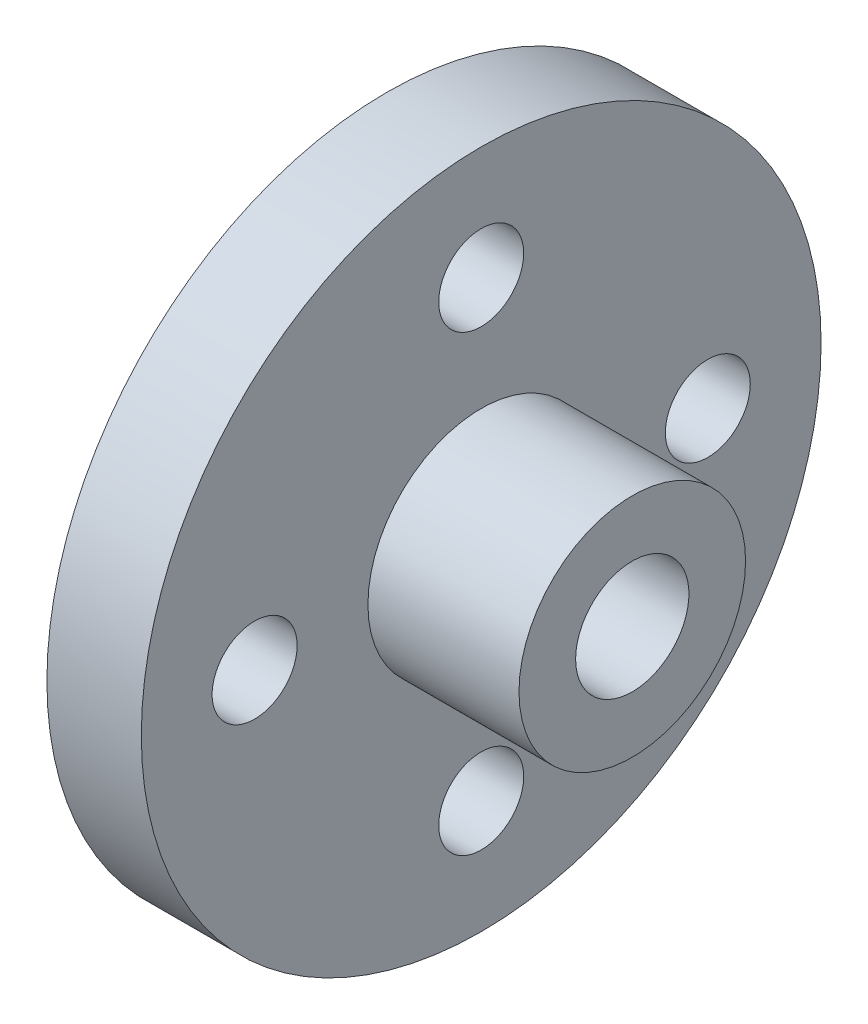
ISO-10303-21;
HEADER;
FILE_DESCRIPTION(('STEP AP214'),'2;1');
FILE_NAME('part.step','',(''),(''),'','','');
FILE_SCHEMA(('AUTOMOTIVE_DESIGN { 1 0 10303 214 1 1 1 1 }'));
ENDSEC;
DATA;
#1=APPLICATION_CONTEXT('core data for automotive mechanical design processes');
#2=APPLICATION_PROTOCOL_DEFINITION('international standard','automotive_design',2000,#1);
#3=PRODUCT_CONTEXT('',#1,'mechanical');
#4=PRODUCT('Part','Part','',(#3));
#5=PRODUCT_RELATED_PRODUCT_CATEGORY('part','',(#4));
#6=PRODUCT_DEFINITION_FORMATION('','',#4);
#7=PRODUCT_DEFINITION_CONTEXT('part definition',#1,'design');
#8=PRODUCT_DEFINITION('design','',#6,#7);
#9=PRODUCT_DEFINITION_SHAPE('','',#8);
#10=(LENGTH_UNIT() NAMED_UNIT(*) SI_UNIT(.MILLI.,.METRE.));
#11=(NAMED_UNIT(*) PLANE_ANGLE_UNIT() SI_UNIT($,.RADIAN.));
#12=(NAMED_UNIT(*) SI_UNIT($,.STERADIAN.) SOLID_ANGLE_UNIT());
#13=UNCERTAINTY_MEASURE_WITH_UNIT(LENGTH_MEASURE(1.E-05),#10,'distance_accuracy_value','');
#14=(GEOMETRIC_REPRESENTATION_CONTEXT(3) GLOBAL_UNCERTAINTY_ASSIGNED_CONTEXT((#13)) GLOBAL_UNIT_ASSIGNED_CONTEXT((#10,
#11,#12)) REPRESENTATION_CONTEXT('',''));
#15=CARTESIAN_POINT('',(0.,0.,0.));
#16=DIRECTION('',(0.,0.,1.));
#17=DIRECTION('',(1.,0.,0.));
#18=AXIS2_PLACEMENT_3D('',#15,#16,#17);
#19=CARTESIAN_POINT('',(-7.9375,0.,0.));
#20=DIRECTION('',(1.,0.,0.));
#21=DIRECTION('',(0.,0.,-1.));
#22=AXIS2_PLACEMENT_3D('',#19,#20,#21);
#23=PLANE('',#22);
#24=CARTESIAN_POINT('',(-7.9375,0.,0.));
#25=DIRECTION('',(-1.,0.,0.));
#26=DIRECTION('',(0.,0.,1.));
#27=AXIS2_PLACEMENT_3D('',#24,#25,#26);
#28=CIRCLE('',#27,28.575);
#29=CARTESIAN_POINT('',(-7.9375,0.,28.575));
#30=VERTEX_POINT('',#29);
#31=EDGE_CURVE('E10',#30,#30,#28,.T.);
#32=ORIENTED_EDGE('',*,*,#31,.T.);
#33=EDGE_LOOP('',(#32));
#34=FACE_BOUND('',#33,.T.);
#35=CARTESIAN_POINT('',(-7.9375,19.05,0.));
#36=DIRECTION('',(1.,0.,0.));
#37=DIRECTION('',(0.,0.,-1.));
#38=AXIS2_PLACEMENT_3D('',#35,#36,#37);
#39=CIRCLE('',#38,3.571875);
#40=CARTESIAN_POINT('',(-7.9375,19.05,-3.571875));
#41=VERTEX_POINT('',#40);
#42=EDGE_CURVE('E48',#41,#41,#39,.T.);
#43=ORIENTED_EDGE('',*,*,#42,.T.);
#44=EDGE_LOOP('',(#43));
#45=FACE_BOUND('',#44,.T.);
#46=CARTESIAN_POINT('',(-7.9375,0.,19.05));
#47=DIRECTION('',(1.,0.,0.));
#48=DIRECTION('',(0.,1.,0.));
#49=AXIS2_PLACEMENT_3D('',#46,#47,#48);
#50=CIRCLE('',#49,3.571875);
#51=CARTESIAN_POINT('',(-7.9375,0.,15.478125));
#52=VERTEX_POINT('',#51);
#53=EDGE_CURVE('E54',#52,#52,#50,.T.);
#54=ORIENTED_EDGE('',*,*,#53,.T.);
#55=EDGE_LOOP('',(#54));
#56=FACE_BOUND('',#55,.T.);
#57=CARTESIAN_POINT('',(-7.9375,-19.05,-1.33025516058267E-13));
#58=DIRECTION('',(1.,0.,0.));
#59=DIRECTION('',(0.,0.,1.));
#60=AXIS2_PLACEMENT_3D('',#57,#58,#59);
#61=CIRCLE('',#60,3.571875);
#62=CARTESIAN_POINT('',(-7.9375,-19.05,-3.57187500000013));
#63=VERTEX_POINT('',#62);
#64=EDGE_CURVE('E60',#63,#63,#61,.T.);
#65=ORIENTED_EDGE('',*,*,#64,.T.);
#66=EDGE_LOOP('',(#65));
#67=FACE_BOUND('',#66,.T.);
#68=CARTESIAN_POINT('',(-7.9375,1.99538274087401E-13,-19.05));
#69=DIRECTION('',(1.,0.,0.));
#70=DIRECTION('',(0.,-1.,0.));
#71=AXIS2_PLACEMENT_3D('',#68,#69,#70);
#72=CIRCLE('',#71,3.571875);
#73=CARTESIAN_POINT('',(-7.9375,1.99538274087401E-13,-22.621875));
#74=VERTEX_POINT('',#73);
#75=EDGE_CURVE('E66',#74,#74,#72,.T.);
#76=ORIENTED_EDGE('',*,*,#75,.T.);
#77=EDGE_LOOP('',(#76));
#78=FACE_BOUND('',#77,.T.);
#79=CARTESIAN_POINT('',(-7.9375,0.,0.));
#80=DIRECTION('',(-1.,0.,0.));
#81=DIRECTION('',(0.,0.,1.));
#82=AXIS2_PLACEMENT_3D('',#79,#80,#81);
#83=CIRCLE('',#82,4.191);
#84=CARTESIAN_POINT('',(-7.9375,0.,4.191));
#85=VERTEX_POINT('',#84);
#86=EDGE_CURVE('E72',#85,#85,#83,.T.);
#87=ORIENTED_EDGE('',*,*,#86,.F.);
#88=EDGE_LOOP('',(#87));
#89=FACE_BOUND('',#88,.T.);
#90=ADVANCED_FACE('F29',(#34,#45,#56,#67,#78,#89),#23,.F.);
#91=CARTESIAN_POINT('',(12.7,9.525,0.));
#92=DIRECTION('',(-1.,0.,0.));
#93=DIRECTION('',(0.,0.,1.));
#94=AXIS2_PLACEMENT_3D('',#91,#92,#93);
#95=PLANE('',#94);
#96=CARTESIAN_POINT('',(12.7,0.,0.));
#97=DIRECTION('',(-1.,0.,0.));
#98=DIRECTION('',(0.,0.,1.));
#99=AXIS2_PLACEMENT_3D('',#96,#97,#98);
#100=CIRCLE('',#99,9.525);
#101=CARTESIAN_POINT('',(12.7,0.,9.525));
#102=VERTEX_POINT('',#101);
#103=EDGE_CURVE('E43',#102,#102,#100,.T.);
#104=ORIENTED_EDGE('',*,*,#103,.F.);
#105=EDGE_LOOP('',(#104));
#106=FACE_BOUND('',#105,.T.);
#107=CARTESIAN_POINT('',(12.7,0.,0.));
#108=DIRECTION('',(-1.,0.,0.));
#109=DIRECTION('',(0.,0.,1.));
#110=AXIS2_PLACEMENT_3D('',#107,#108,#109);
#111=CIRCLE('',#110,4.7625);
#112=CARTESIAN_POINT('',(12.7,0.,4.7625));
#113=VERTEX_POINT('',#112);
#114=EDGE_CURVE('E81',#113,#113,#111,.T.);
#115=ORIENTED_EDGE('',*,*,#114,.T.);
#116=EDGE_LOOP('',(#115));
#117=FACE_BOUND('',#116,.T.);
#118=ADVANCED_FACE('F85',(#106,#117),#95,.F.);
#119=CARTESIAN_POINT('',(-16.9594650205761,0.,0.));
#120=DIRECTION('',(-1.,0.,0.));
#121=DIRECTION('',(0.,0.,1.));
#122=AXIS2_PLACEMENT_3D('',#119,#120,#121);
#123=CYLINDRICAL_SURFACE('',#122,28.575);
#124=ORIENTED_EDGE('',*,*,#31,.F.);
#125=EDGE_LOOP('',(#124));
#126=FACE_BOUND('',#125,.T.);
#127=CARTESIAN_POINT('',(0.,0.,0.));
#128=DIRECTION('',(-1.,0.,0.));
#129=DIRECTION('',(0.,0.,1.));
#130=AXIS2_PLACEMENT_3D('',#127,#128,#129);
#131=CIRCLE('',#130,28.575);
#132=CARTESIAN_POINT('',(0.,0.,28.575));
#133=VERTEX_POINT('',#132);
#134=EDGE_CURVE('E35',#133,#133,#131,.T.);
#135=ORIENTED_EDGE('',*,*,#134,.T.);
#136=EDGE_LOOP('',(#135));
#137=FACE_BOUND('',#136,.T.);
#138=ADVANCED_FACE('F102',(#126,#137),#123,.T.);
#139=CARTESIAN_POINT('',(0.,28.575,0.));
#140=DIRECTION('',(-1.,0.,0.));
#141=DIRECTION('',(0.,0.,1.));
#142=AXIS2_PLACEMENT_3D('',#139,#140,#141);
#143=PLANE('',#142);
#144=CARTESIAN_POINT('',(0.,1.99538274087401E-13,-19.05));
#145=DIRECTION('',(1.,0.,0.));
#146=DIRECTION('',(0.,-1.,0.));
#147=AXIS2_PLACEMENT_3D('',#144,#145,#146);
#148=CIRCLE('',#147,3.571875);
#149=CARTESIAN_POINT('',(0.,1.99538274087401E-13,-22.621875));
#150=VERTEX_POINT('',#149);
#151=EDGE_CURVE('E69',#150,#150,#148,.T.);
#152=ORIENTED_EDGE('',*,*,#151,.F.);
#153=EDGE_LOOP('',(#152));
#154=FACE_BOUND('',#153,.T.);
#155=CARTESIAN_POINT('',(0.,-19.05,-1.33025516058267E-13));
#156=DIRECTION('',(1.,0.,0.));
#157=DIRECTION('',(0.,0.,1.));
#158=AXIS2_PLACEMENT_3D('',#155,#156,#157);
#159=CIRCLE('',#158,3.571875);
#160=CARTESIAN_POINT('',(0.,-19.05,-3.57187500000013));
#161=VERTEX_POINT('',#160);
#162=EDGE_CURVE('E63',#161,#161,#159,.T.);
#163=ORIENTED_EDGE('',*,*,#162,.F.);
#164=EDGE_LOOP('',(#163));
#165=FACE_BOUND('',#164,.T.);
#166=CARTESIAN_POINT('',(0.,0.,19.05));
#167=DIRECTION('',(1.,0.,0.));
#168=DIRECTION('',(0.,1.,0.));
#169=AXIS2_PLACEMENT_3D('',#166,#167,#168);
#170=CIRCLE('',#169,3.571875);
#171=CARTESIAN_POINT('',(0.,0.,15.478125));
#172=VERTEX_POINT('',#171);
#173=EDGE_CURVE('E57',#172,#172,#170,.T.);
#174=ORIENTED_EDGE('',*,*,#173,.F.);
#175=EDGE_LOOP('',(#174));
#176=FACE_BOUND('',#175,.T.);
#177=CARTESIAN_POINT('',(0.,19.05,0.));
#178=DIRECTION('',(1.,0.,0.));
#179=DIRECTION('',(0.,0.,-1.));
#180=AXIS2_PLACEMENT_3D('',#177,#178,#179);
#181=CIRCLE('',#180,3.571875);
#182=CARTESIAN_POINT('',(0.,19.05,-3.571875));
#183=VERTEX_POINT('',#182);
#184=EDGE_CURVE('E51',#183,#183,#181,.T.);
#185=ORIENTED_EDGE('',*,*,#184,.F.);
#186=EDGE_LOOP('',(#185));
#187=FACE_BOUND('',#186,.T.);
#188=ORIENTED_EDGE('',*,*,#134,.F.);
#189=EDGE_LOOP('',(#188));
#190=FACE_BOUND('',#189,.T.);
#191=CARTESIAN_POINT('',(0.,0.,0.));
#192=DIRECTION('',(-1.,0.,0.));
#193=DIRECTION('',(0.,0.,1.));
#194=AXIS2_PLACEMENT_3D('',#191,#192,#193);
#195=CIRCLE('',#194,9.525);
#196=CARTESIAN_POINT('',(0.,0.,9.525));
#197=VERTEX_POINT('',#196);
#198=EDGE_CURVE('E39',#197,#197,#195,.T.);
#199=ORIENTED_EDGE('',*,*,#198,.T.);
#200=EDGE_LOOP('',(#199));
#201=FACE_BOUND('',#200,.T.);
#202=ADVANCED_FACE('F144',(#154,#165,#176,#187,#190,#201),#143,.F.);
#203=CARTESIAN_POINT('',(-16.9594650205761,0.,0.));
#204=DIRECTION('',(-1.,0.,0.));
#205=DIRECTION('',(0.,0.,1.));
#206=AXIS2_PLACEMENT_3D('',#203,#204,#205);
#207=CYLINDRICAL_SURFACE('',#206,9.525);
#208=ORIENTED_EDGE('',*,*,#198,.F.);
#209=EDGE_LOOP('',(#208));
#210=FACE_BOUND('',#209,.T.);
#211=ORIENTED_EDGE('',*,*,#103,.T.);
#212=EDGE_LOOP('',(#211));
#213=FACE_BOUND('',#212,.T.);
#214=ADVANCED_FACE('F139',(#210,#213),#207,.T.);
#215=CARTESIAN_POINT('',(-7.9375,19.05,0.));
#216=DIRECTION('',(1.,0.,0.));
#217=DIRECTION('',(0.,0.,-1.));
#218=AXIS2_PLACEMENT_3D('',#215,#216,#217);
#219=CYLINDRICAL_SURFACE('',#218,3.571875);
#220=CARTESIAN_POINT('',(-7.9375,19.05,-3.571875));
#221=CARTESIAN_POINT('',(-7.85481770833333,19.05,-3.571875));
#222=CARTESIAN_POINT('',(-7.77213541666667,19.05,-3.571875));
#223=CARTESIAN_POINT('',(-7.60677083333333,19.05,-3.571875));
#224=CARTESIAN_POINT('',(-7.52408854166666,19.05,-3.571875));
#225=CARTESIAN_POINT('',(-7.35872395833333,19.05,-3.571875));
#226=CARTESIAN_POINT('',(-7.27604166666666,19.05,-3.571875));
#227=CARTESIAN_POINT('',(-7.11067708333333,19.05,-3.571875));
#228=CARTESIAN_POINT('',(-7.02799479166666,19.05,-3.571875));
#229=CARTESIAN_POINT('',(-6.86263020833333,19.05,-3.571875));
#230=CARTESIAN_POINT('',(-6.77994791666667,19.05,-3.571875));
#231=CARTESIAN_POINT('',(-6.61458333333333,19.05,-3.571875));
#232=CARTESIAN_POINT('',(-6.53190104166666,19.05,-3.571875));
#233=CARTESIAN_POINT('',(-6.36653645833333,19.05,-3.571875));
#234=CARTESIAN_POINT('',(-6.28385416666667,19.05,-3.571875));
#235=CARTESIAN_POINT('',(-6.11848958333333,19.05,-3.571875));
#236=CARTESIAN_POINT('',(-6.03580729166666,19.05,-3.571875));
#237=CARTESIAN_POINT('',(-5.87044270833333,19.05,-3.571875));
#238=CARTESIAN_POINT('',(-5.78776041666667,19.05,-3.571875));
#239=CARTESIAN_POINT('',(-5.62239583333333,19.05,-3.571875));
#240=CARTESIAN_POINT('',(-5.53971354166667,19.05,-3.571875));
#241=CARTESIAN_POINT('',(-5.37434895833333,19.05,-3.571875));
#242=CARTESIAN_POINT('',(-5.29166666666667,19.05,-3.571875));
#243=CARTESIAN_POINT('',(-5.12630208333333,19.05,-3.571875));
#244=CARTESIAN_POINT('',(-5.04361979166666,19.05,-3.571875));
#245=CARTESIAN_POINT('',(-4.87825520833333,19.05,-3.571875));
#246=CARTESIAN_POINT('',(-4.79557291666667,19.05,-3.571875));
#247=CARTESIAN_POINT('',(-4.63020833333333,19.05,-3.571875));
#248=CARTESIAN_POINT('',(-4.54752604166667,19.05,-3.571875));
#249=CARTESIAN_POINT('',(-4.38216145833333,19.05,-3.571875));
#250=CARTESIAN_POINT('',(-4.29947916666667,19.05,-3.571875));
#251=CARTESIAN_POINT('',(-4.13411458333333,19.05,-3.571875));
#252=CARTESIAN_POINT('',(-4.05143229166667,19.05,-3.571875));
#253=CARTESIAN_POINT('',(-3.88606770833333,19.05,-3.571875));
#254=CARTESIAN_POINT('',(-3.80338541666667,19.05,-3.571875));
#255=CARTESIAN_POINT('',(-3.63802083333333,19.05,-3.571875));
#256=CARTESIAN_POINT('',(-3.55533854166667,19.05,-3.571875));
#257=CARTESIAN_POINT('',(-3.38997395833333,19.05,-3.571875));
#258=CARTESIAN_POINT('',(-3.30729166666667,19.05,-3.571875));
#259=CARTESIAN_POINT('',(-3.14192708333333,19.05,-3.571875));
#260=CARTESIAN_POINT('',(-3.05924479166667,19.05,-3.571875));
#261=CARTESIAN_POINT('',(-2.89388020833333,19.05,-3.571875));
#262=CARTESIAN_POINT('',(-2.81119791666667,19.05,-3.571875));
#263=CARTESIAN_POINT('',(-2.64583333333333,19.05,-3.571875));
#264=CARTESIAN_POINT('',(-2.56315104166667,19.05,-3.571875));
#265=CARTESIAN_POINT('',(-2.39778645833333,19.05,-3.571875));
#266=CARTESIAN_POINT('',(-2.31510416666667,19.05,-3.571875));
#267=CARTESIAN_POINT('',(-2.14973958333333,19.05,-3.571875));
#268=CARTESIAN_POINT('',(-2.06705729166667,19.05,-3.571875));
#269=CARTESIAN_POINT('',(-1.90169270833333,19.05,-3.571875));
#270=CARTESIAN_POINT('',(-1.81901041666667,19.05,-3.571875));
#271=CARTESIAN_POINT('',(-1.65364583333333,19.05,-3.571875));
#272=CARTESIAN_POINT('',(-1.57096354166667,19.05,-3.571875));
#273=CARTESIAN_POINT('',(-1.40559895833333,19.05,-3.571875));
#274=CARTESIAN_POINT('',(-1.32291666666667,19.05,-3.571875));
#275=CARTESIAN_POINT('',(-1.15755208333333,19.05,-3.571875));
#276=CARTESIAN_POINT('',(-1.07486979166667,19.05,-3.571875));
#277=CARTESIAN_POINT('',(-0.909505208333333,19.05,-3.571875));
#278=CARTESIAN_POINT('',(-0.826822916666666,19.05,-3.571875));
#279=CARTESIAN_POINT('',(-0.661458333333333,19.05,-3.571875));
#280=CARTESIAN_POINT('',(-0.578776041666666,19.05,-3.571875));
#281=CARTESIAN_POINT('',(-0.413411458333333,19.05,-3.571875));
#282=CARTESIAN_POINT('',(-0.330729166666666,19.05,-3.571875));
#283=CARTESIAN_POINT('',(-0.165364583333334,19.05,-3.571875));
#284=CARTESIAN_POINT('',(-0.0826822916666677,19.05,-3.571875));
#285=CARTESIAN_POINT('',(0.,19.05,-3.571875));
#286=B_SPLINE_CURVE_WITH_KNOTS('',3,(#220,#221,#222,#223,#224,#225,#226,#227,#228,#229,#230,
#231,#232,#233,#234,#235,#236,#237,#238,#239,#240,#241,#242,#243,#244,#245,#246,#247,#248,#249,
#250,#251,#252,#253,#254,#255,#256,#257,#258,#259,#260,#261,#262,#263,#264,#265,#266,#267,#268,
#269,#270,#271,#272,#273,#274,#275,#276,#277,#278,#279,#280,#281,#282,#283,#284,#285),
.UNSPECIFIED.,.F.,.F.,(4,2,2,2,2,2,2,2,2,2,2,2,2,2,2,2,2,2,2,2,2,2,2,2,2,2,2,2,2,2,2,2,4),(0.,
0.248046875,0.496093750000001,0.744140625,0.9921875,1.240234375,1.48828125,1.736328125,1.984375,
2.232421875,2.48046875,2.728515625,2.9765625,3.224609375,3.47265625,3.720703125,3.96875,
4.216796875,4.46484375,4.712890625,4.9609375,5.208984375,5.45703125,5.705078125,5.953125,
6.201171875,6.44921875,6.697265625,6.9453125,7.193359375,7.44140625,7.689453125,7.9375),.UNSPECIFIED.);
#287=EDGE_CURVE('BSEAM136',#41,#183,#286,.T.);
#288=ORIENTED_EDGE('',*,*,#42,.F.);
#289=ORIENTED_EDGE('',*,*,#184,.T.);
#290=ORIENTED_EDGE('',*,*,#287,.T.);
#291=ORIENTED_EDGE('',*,*,#287,.F.);
#292=EDGE_LOOP('',(#288,#290,#289,#291));
#293=FACE_BOUND('',#292,.T.);
#294=ADVANCED_FACE('F136',(#293),#219,.F.);
#295=CARTESIAN_POINT('',(-7.9375,0.,19.05));
#296=DIRECTION('',(1.,0.,0.));
#297=DIRECTION('',(0.,0.,-1.));
#298=AXIS2_PLACEMENT_3D('',#295,#296,#297);
#299=CYLINDRICAL_SURFACE('',#298,3.571875);
#300=CARTESIAN_POINT('',(-7.9375,0.,15.478125));
#301=CARTESIAN_POINT('',(-7.85481770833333,0.,15.478125));
#302=CARTESIAN_POINT('',(-7.77213541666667,0.,15.478125));
#303=CARTESIAN_POINT('',(-7.60677083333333,0.,15.478125));
#304=CARTESIAN_POINT('',(-7.52408854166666,0.,15.478125));
#305=CARTESIAN_POINT('',(-7.35872395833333,0.,15.478125));
#306=CARTESIAN_POINT('',(-7.27604166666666,0.,15.478125));
#307=CARTESIAN_POINT('',(-7.11067708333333,0.,15.478125));
#308=CARTESIAN_POINT('',(-7.02799479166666,0.,15.478125));
#309=CARTESIAN_POINT('',(-6.86263020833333,0.,15.478125));
#310=CARTESIAN_POINT('',(-6.77994791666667,0.,15.478125));
#311=CARTESIAN_POINT('',(-6.61458333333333,0.,15.478125));
#312=CARTESIAN_POINT('',(-6.53190104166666,0.,15.478125));
#313=CARTESIAN_POINT('',(-6.36653645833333,0.,15.478125));
#314=CARTESIAN_POINT('',(-6.28385416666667,0.,15.478125));
#315=CARTESIAN_POINT('',(-6.11848958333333,0.,15.478125));
#316=CARTESIAN_POINT('',(-6.03580729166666,0.,15.478125));
#317=CARTESIAN_POINT('',(-5.87044270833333,0.,15.478125));
#318=CARTESIAN_POINT('',(-5.78776041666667,0.,15.478125));
#319=CARTESIAN_POINT('',(-5.62239583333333,0.,15.478125));
#320=CARTESIAN_POINT('',(-5.53971354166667,0.,15.478125));
#321=CARTESIAN_POINT('',(-5.37434895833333,0.,15.478125));
#322=CARTESIAN_POINT('',(-5.29166666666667,0.,15.478125));
#323=CARTESIAN_POINT('',(-5.12630208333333,0.,15.478125));
#324=CARTESIAN_POINT('',(-5.04361979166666,0.,15.478125));
#325=CARTESIAN_POINT('',(-4.87825520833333,0.,15.478125));
#326=CARTESIAN_POINT('',(-4.79557291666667,0.,15.478125));
#327=CARTESIAN_POINT('',(-4.63020833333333,0.,15.478125));
#328=CARTESIAN_POINT('',(-4.54752604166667,0.,15.478125));
#329=CARTESIAN_POINT('',(-4.38216145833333,0.,15.478125));
#330=CARTESIAN_POINT('',(-4.29947916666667,0.,15.478125));
#331=CARTESIAN_POINT('',(-4.13411458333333,0.,15.478125));
#332=CARTESIAN_POINT('',(-4.05143229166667,0.,15.478125));
#333=CARTESIAN_POINT('',(-3.88606770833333,0.,15.478125));
#334=CARTESIAN_POINT('',(-3.80338541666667,0.,15.478125));
#335=CARTESIAN_POINT('',(-3.63802083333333,0.,15.478125));
#336=CARTESIAN_POINT('',(-3.55533854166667,0.,15.478125));
#337=CARTESIAN_POINT('',(-3.38997395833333,0.,15.478125));
#338=CARTESIAN_POINT('',(-3.30729166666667,0.,15.478125));
#339=CARTESIAN_POINT('',(-3.14192708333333,0.,15.478125));
#340=CARTESIAN_POINT('',(-3.05924479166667,0.,15.478125));
#341=CARTESIAN_POINT('',(-2.89388020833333,0.,15.478125));
#342=CARTESIAN_POINT('',(-2.81119791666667,0.,15.478125));
#343=CARTESIAN_POINT('',(-2.64583333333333,0.,15.478125));
#344=CARTESIAN_POINT('',(-2.56315104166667,0.,15.478125));
#345=CARTESIAN_POINT('',(-2.39778645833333,0.,15.478125));
#346=CARTESIAN_POINT('',(-2.31510416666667,0.,15.478125));
#347=CARTESIAN_POINT('',(-2.14973958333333,0.,15.478125));
#348=CARTESIAN_POINT('',(-2.06705729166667,0.,15.478125));
#349=CARTESIAN_POINT('',(-1.90169270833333,0.,15.478125));
#350=CARTESIAN_POINT('',(-1.81901041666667,0.,15.478125));
#351=CARTESIAN_POINT('',(-1.65364583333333,0.,15.478125));
#352=CARTESIAN_POINT('',(-1.57096354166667,0.,15.478125));
#353=CARTESIAN_POINT('',(-1.40559895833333,0.,15.478125));
#354=CARTESIAN_POINT('',(-1.32291666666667,0.,15.478125));
#355=CARTESIAN_POINT('',(-1.15755208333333,0.,15.478125));
#356=CARTESIAN_POINT('',(-1.07486979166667,0.,15.478125));
#357=CARTESIAN_POINT('',(-0.909505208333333,0.,15.478125));
#358=CARTESIAN_POINT('',(-0.826822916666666,0.,15.478125));
#359=CARTESIAN_POINT('',(-0.661458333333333,0.,15.478125));
#360=CARTESIAN_POINT('',(-0.578776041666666,0.,15.478125));
#361=CARTESIAN_POINT('',(-0.413411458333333,0.,15.478125));
#362=CARTESIAN_POINT('',(-0.330729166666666,0.,15.478125));
#363=CARTESIAN_POINT('',(-0.165364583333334,0.,15.478125));
#364=CARTESIAN_POINT('',(-0.0826822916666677,0.,15.478125));
#365=CARTESIAN_POINT('',(0.,0.,15.478125));
#366=B_SPLINE_CURVE_WITH_KNOTS('',3,(#300,#301,#302,#303,#304,#305,#306,#307,#308,#309,#310,
#311,#312,#313,#314,#315,#316,#317,#318,#319,#320,#321,#322,#323,#324,#325,#326,#327,#328,#329,
#330,#331,#332,#333,#334,#335,#336,#337,#338,#339,#340,#341,#342,#343,#344,#345,#346,#347,#348,
#349,#350,#351,#352,#353,#354,#355,#356,#357,#358,#359,#360,#361,#362,#363,#364,#365),
.UNSPECIFIED.,.F.,.F.,(4,2,2,2,2,2,2,2,2,2,2,2,2,2,2,2,2,2,2,2,2,2,2,2,2,2,2,2,2,2,2,2,4),(0.,
0.248046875,0.496093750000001,0.744140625,0.9921875,1.240234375,1.48828125,1.736328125,1.984375,
2.232421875,2.48046875,2.728515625,2.9765625,3.224609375,3.47265625,3.720703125,3.96875,
4.216796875,4.46484375,4.712890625,4.9609375,5.208984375,5.45703125,5.705078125,5.953125,
6.201171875,6.44921875,6.697265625,6.9453125,7.193359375,7.44140625,7.689453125,7.9375),.UNSPECIFIED.);
#367=EDGE_CURVE('BSEAM132',#52,#172,#366,.T.);
#368=ORIENTED_EDGE('',*,*,#53,.F.);
#369=ORIENTED_EDGE('',*,*,#173,.T.);
#370=ORIENTED_EDGE('',*,*,#367,.T.);
#371=ORIENTED_EDGE('',*,*,#367,.F.);
#372=EDGE_LOOP('',(#368,#370,#369,#371));
#373=FACE_BOUND('',#372,.T.);
#374=ADVANCED_FACE('F132',(#373),#299,.F.);
#375=CARTESIAN_POINT('',(-7.9375,-19.05,-1.33025516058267E-13));
#376=DIRECTION('',(1.,0.,0.));
#377=DIRECTION('',(0.,0.,-1.));
#378=AXIS2_PLACEMENT_3D('',#375,#376,#377);
#379=CYLINDRICAL_SURFACE('',#378,3.571875);
#380=CARTESIAN_POINT('',(-7.9375,-19.05,-3.57187500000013));
#381=CARTESIAN_POINT('',(-7.85481770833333,-19.05,-3.57187500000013));
#382=CARTESIAN_POINT('',(-7.77213541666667,-19.05,-3.57187500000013));
#383=CARTESIAN_POINT('',(-7.60677083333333,-19.05,-3.57187500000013));
#384=CARTESIAN_POINT('',(-7.52408854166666,-19.05,-3.57187500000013));
#385=CARTESIAN_POINT('',(-7.35872395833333,-19.05,-3.57187500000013));
#386=CARTESIAN_POINT('',(-7.27604166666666,-19.05,-3.57187500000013));
#387=CARTESIAN_POINT('',(-7.11067708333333,-19.05,-3.57187500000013));
#388=CARTESIAN_POINT('',(-7.02799479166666,-19.05,-3.57187500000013));
#389=CARTESIAN_POINT('',(-6.86263020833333,-19.05,-3.57187500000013));
#390=CARTESIAN_POINT('',(-6.77994791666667,-19.05,-3.57187500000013));
#391=CARTESIAN_POINT('',(-6.61458333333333,-19.05,-3.57187500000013));
#392=CARTESIAN_POINT('',(-6.53190104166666,-19.05,-3.57187500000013));
#393=CARTESIAN_POINT('',(-6.36653645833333,-19.05,-3.57187500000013));
#394=CARTESIAN_POINT('',(-6.28385416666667,-19.05,-3.57187500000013));
#395=CARTESIAN_POINT('',(-6.11848958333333,-19.05,-3.57187500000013));
#396=CARTESIAN_POINT('',(-6.03580729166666,-19.05,-3.57187500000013));
#397=CARTESIAN_POINT('',(-5.87044270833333,-19.05,-3.57187500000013));
#398=CARTESIAN_POINT('',(-5.78776041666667,-19.05,-3.57187500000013));
#399=CARTESIAN_POINT('',(-5.62239583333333,-19.05,-3.57187500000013));
#400=CARTESIAN_POINT('',(-5.53971354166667,-19.05,-3.57187500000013));
#401=CARTESIAN_POINT('',(-5.37434895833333,-19.05,-3.57187500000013));
#402=CARTESIAN_POINT('',(-5.29166666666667,-19.05,-3.57187500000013));
#403=CARTESIAN_POINT('',(-5.12630208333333,-19.05,-3.57187500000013));
#404=CARTESIAN_POINT('',(-5.04361979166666,-19.05,-3.57187500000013));
#405=CARTESIAN_POINT('',(-4.87825520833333,-19.05,-3.57187500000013));
#406=CARTESIAN_POINT('',(-4.79557291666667,-19.05,-3.57187500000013));
#407=CARTESIAN_POINT('',(-4.63020833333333,-19.05,-3.57187500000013));
#408=CARTESIAN_POINT('',(-4.54752604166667,-19.05,-3.57187500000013));
#409=CARTESIAN_POINT('',(-4.38216145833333,-19.05,-3.57187500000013));
#410=CARTESIAN_POINT('',(-4.29947916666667,-19.05,-3.57187500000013));
#411=CARTESIAN_POINT('',(-4.13411458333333,-19.05,-3.57187500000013));
#412=CARTESIAN_POINT('',(-4.05143229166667,-19.05,-3.57187500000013));
#413=CARTESIAN_POINT('',(-3.88606770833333,-19.05,-3.57187500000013));
#414=CARTESIAN_POINT('',(-3.80338541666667,-19.05,-3.57187500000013));
#415=CARTESIAN_POINT('',(-3.63802083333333,-19.05,-3.57187500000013));
#416=CARTESIAN_POINT('',(-3.55533854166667,-19.05,-3.57187500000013));
#417=CARTESIAN_POINT('',(-3.38997395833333,-19.05,-3.57187500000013));
#418=CARTESIAN_POINT('',(-3.30729166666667,-19.05,-3.57187500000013));
#419=CARTESIAN_POINT('',(-3.14192708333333,-19.05,-3.57187500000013));
#420=CARTESIAN_POINT('',(-3.05924479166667,-19.05,-3.57187500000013));
#421=CARTESIAN_POINT('',(-2.89388020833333,-19.05,-3.57187500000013));
#422=CARTESIAN_POINT('',(-2.81119791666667,-19.05,-3.57187500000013));
#423=CARTESIAN_POINT('',(-2.64583333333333,-19.05,-3.57187500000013));
#424=CARTESIAN_POINT('',(-2.56315104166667,-19.05,-3.57187500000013));
#425=CARTESIAN_POINT('',(-2.39778645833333,-19.05,-3.57187500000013));
#426=CARTESIAN_POINT('',(-2.31510416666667,-19.05,-3.57187500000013));
#427=CARTESIAN_POINT('',(-2.14973958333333,-19.05,-3.57187500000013));
#428=CARTESIAN_POINT('',(-2.06705729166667,-19.05,-3.57187500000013));
#429=CARTESIAN_POINT('',(-1.90169270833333,-19.05,-3.57187500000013));
#430=CARTESIAN_POINT('',(-1.81901041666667,-19.05,-3.57187500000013));
#431=CARTESIAN_POINT('',(-1.65364583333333,-19.05,-3.57187500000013));
#432=CARTESIAN_POINT('',(-1.57096354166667,-19.05,-3.57187500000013));
#433=CARTESIAN_POINT('',(-1.40559895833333,-19.05,-3.57187500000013));
#434=CARTESIAN_POINT('',(-1.32291666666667,-19.05,-3.57187500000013));
#435=CARTESIAN_POINT('',(-1.15755208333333,-19.05,-3.57187500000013));
#436=CARTESIAN_POINT('',(-1.07486979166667,-19.05,-3.57187500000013));
#437=CARTESIAN_POINT('',(-0.909505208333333,-19.05,-3.57187500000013));
#438=CARTESIAN_POINT('',(-0.826822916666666,-19.05,-3.57187500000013));
#439=CARTESIAN_POINT('',(-0.661458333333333,-19.05,-3.57187500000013));
#440=CARTESIAN_POINT('',(-0.578776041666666,-19.05,-3.57187500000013));
#441=CARTESIAN_POINT('',(-0.413411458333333,-19.05,-3.57187500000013));
#442=CARTESIAN_POINT('',(-0.330729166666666,-19.05,-3.57187500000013));
#443=CARTESIAN_POINT('',(-0.165364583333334,-19.05,-3.57187500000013));
#444=CARTESIAN_POINT('',(-0.0826822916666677,-19.05,-3.57187500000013));
#445=CARTESIAN_POINT('',(0.,-19.05,-3.57187500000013));
#446=B_SPLINE_CURVE_WITH_KNOTS('',3,(#380,#381,#382,#383,#384,#385,#386,#387,#388,#389,#390,
#391,#392,#393,#394,#395,#396,#397,#398,#399,#400,#401,#402,#403,#404,#405,#406,#407,#408,#409,
#410,#411,#412,#413,#414,#415,#416,#417,#418,#419,#420,#421,#422,#423,#424,#425,#426,#427,#428,
#429,#430,#431,#432,#433,#434,#435,#436,#437,#438,#439,#440,#441,#442,#443,#444,#445),
.UNSPECIFIED.,.F.,.F.,(4,2,2,2,2,2,2,2,2,2,2,2,2,2,2,2,2,2,2,2,2,2,2,2,2,2,2,2,2,2,2,2,4),(0.,
0.248046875,0.496093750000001,0.744140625,0.9921875,1.240234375,1.48828125,1.736328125,1.984375,
2.232421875,2.48046875,2.728515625,2.9765625,3.224609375,3.47265625,3.720703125,3.96875,
4.216796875,4.46484375,4.712890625,4.9609375,5.208984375,5.45703125,5.705078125,5.953125,
6.201171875,6.44921875,6.697265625,6.9453125,7.193359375,7.44140625,7.689453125,7.9375),.UNSPECIFIED.);
#447=EDGE_CURVE('BSEAM126',#63,#161,#446,.T.);
#448=ORIENTED_EDGE('',*,*,#64,.F.);
#449=ORIENTED_EDGE('',*,*,#162,.T.);
#450=ORIENTED_EDGE('',*,*,#447,.T.);
#451=ORIENTED_EDGE('',*,*,#447,.F.);
#452=EDGE_LOOP('',(#448,#450,#449,#451));
#453=FACE_BOUND('',#452,.T.);
#454=ADVANCED_FACE('F126',(#453),#379,.F.);
#455=CARTESIAN_POINT('',(-7.9375,1.99538274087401E-13,-19.05));
#456=DIRECTION('',(1.,0.,0.));
#457=DIRECTION('',(0.,0.,-1.));
#458=AXIS2_PLACEMENT_3D('',#455,#456,#457);
#459=CYLINDRICAL_SURFACE('',#458,3.571875);
#460=CARTESIAN_POINT('',(-7.9375,1.99538274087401E-13,-22.621875));
#461=CARTESIAN_POINT('',(-7.85481770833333,1.99538274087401E-13,-22.621875));
#462=CARTESIAN_POINT('',(-7.77213541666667,1.99538274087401E-13,-22.621875));
#463=CARTESIAN_POINT('',(-7.60677083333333,1.99538274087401E-13,-22.621875));
#464=CARTESIAN_POINT('',(-7.52408854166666,1.99538274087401E-13,-22.621875));
#465=CARTESIAN_POINT('',(-7.35872395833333,1.99538274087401E-13,-22.621875));
#466=CARTESIAN_POINT('',(-7.27604166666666,1.99538274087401E-13,-22.621875));
#467=CARTESIAN_POINT('',(-7.11067708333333,1.99538274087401E-13,-22.621875));
#468=CARTESIAN_POINT('',(-7.02799479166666,1.99538274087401E-13,-22.621875));
#469=CARTESIAN_POINT('',(-6.86263020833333,1.99538274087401E-13,-22.621875));
#470=CARTESIAN_POINT('',(-6.77994791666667,1.99538274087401E-13,-22.621875));
#471=CARTESIAN_POINT('',(-6.61458333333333,1.99538274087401E-13,-22.621875));
#472=CARTESIAN_POINT('',(-6.53190104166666,1.99538274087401E-13,-22.621875));
#473=CARTESIAN_POINT('',(-6.36653645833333,1.99538274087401E-13,-22.621875));
#474=CARTESIAN_POINT('',(-6.28385416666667,1.99538274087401E-13,-22.621875));
#475=CARTESIAN_POINT('',(-6.11848958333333,1.99538274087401E-13,-22.621875));
#476=CARTESIAN_POINT('',(-6.03580729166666,1.99538274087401E-13,-22.621875));
#477=CARTESIAN_POINT('',(-5.87044270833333,1.99538274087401E-13,-22.621875));
#478=CARTESIAN_POINT('',(-5.78776041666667,1.99538274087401E-13,-22.621875));
#479=CARTESIAN_POINT('',(-5.62239583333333,1.99538274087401E-13,-22.621875));
#480=CARTESIAN_POINT('',(-5.53971354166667,1.99538274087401E-13,-22.621875));
#481=CARTESIAN_POINT('',(-5.37434895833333,1.99538274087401E-13,-22.621875));
#482=CARTESIAN_POINT('',(-5.29166666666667,1.99538274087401E-13,-22.621875));
#483=CARTESIAN_POINT('',(-5.12630208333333,1.99538274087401E-13,-22.621875));
#484=CARTESIAN_POINT('',(-5.04361979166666,1.99538274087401E-13,-22.621875));
#485=CARTESIAN_POINT('',(-4.87825520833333,1.99538274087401E-13,-22.621875));
#486=CARTESIAN_POINT('',(-4.79557291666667,1.99538274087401E-13,-22.621875));
#487=CARTESIAN_POINT('',(-4.63020833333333,1.99538274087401E-13,-22.621875));
#488=CARTESIAN_POINT('',(-4.54752604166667,1.99538274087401E-13,-22.621875));
#489=CARTESIAN_POINT('',(-4.38216145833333,1.99538274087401E-13,-22.621875));
#490=CARTESIAN_POINT('',(-4.29947916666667,1.99538274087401E-13,-22.621875));
#491=CARTESIAN_POINT('',(-4.13411458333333,1.99538274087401E-13,-22.621875));
#492=CARTESIAN_POINT('',(-4.05143229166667,1.99538274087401E-13,-22.621875));
#493=CARTESIAN_POINT('',(-3.88606770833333,1.99538274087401E-13,-22.621875));
#494=CARTESIAN_POINT('',(-3.80338541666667,1.99538274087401E-13,-22.621875));
#495=CARTESIAN_POINT('',(-3.63802083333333,1.99538274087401E-13,-22.621875));
#496=CARTESIAN_POINT('',(-3.55533854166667,1.99538274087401E-13,-22.621875));
#497=CARTESIAN_POINT('',(-3.38997395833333,1.99538274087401E-13,-22.621875));
#498=CARTESIAN_POINT('',(-3.30729166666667,1.99538274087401E-13,-22.621875));
#499=CARTESIAN_POINT('',(-3.14192708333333,1.99538274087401E-13,-22.621875));
#500=CARTESIAN_POINT('',(-3.05924479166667,1.99538274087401E-13,-22.621875));
#501=CARTESIAN_POINT('',(-2.89388020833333,1.99538274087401E-13,-22.621875));
#502=CARTESIAN_POINT('',(-2.81119791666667,1.99538274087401E-13,-22.621875));
#503=CARTESIAN_POINT('',(-2.64583333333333,1.99538274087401E-13,-22.621875));
#504=CARTESIAN_POINT('',(-2.56315104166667,1.99538274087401E-13,-22.621875));
#505=CARTESIAN_POINT('',(-2.39778645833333,1.99538274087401E-13,-22.621875));
#506=CARTESIAN_POINT('',(-2.31510416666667,1.99538274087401E-13,-22.621875));
#507=CARTESIAN_POINT('',(-2.14973958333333,1.99538274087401E-13,-22.621875));
#508=CARTESIAN_POINT('',(-2.06705729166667,1.99538274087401E-13,-22.621875));
#509=CARTESIAN_POINT('',(-1.90169270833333,1.99538274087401E-13,-22.621875));
#510=CARTESIAN_POINT('',(-1.81901041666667,1.99538274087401E-13,-22.621875));
#511=CARTESIAN_POINT('',(-1.65364583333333,1.99538274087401E-13,-22.621875));
#512=CARTESIAN_POINT('',(-1.57096354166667,1.99538274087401E-13,-22.621875));
#513=CARTESIAN_POINT('',(-1.40559895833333,1.99538274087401E-13,-22.621875));
#514=CARTESIAN_POINT('',(-1.32291666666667,1.99538274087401E-13,-22.621875));
#515=CARTESIAN_POINT('',(-1.15755208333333,1.99538274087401E-13,-22.621875));
#516=CARTESIAN_POINT('',(-1.07486979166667,1.99538274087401E-13,-22.621875));
#517=CARTESIAN_POINT('',(-0.909505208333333,1.99538274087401E-13,-22.621875));
#518=CARTESIAN_POINT('',(-0.826822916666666,1.99538274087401E-13,-22.621875));
#519=CARTESIAN_POINT('',(-0.661458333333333,1.99538274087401E-13,-22.621875));
#520=CARTESIAN_POINT('',(-0.578776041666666,1.99538274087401E-13,-22.621875));
#521=CARTESIAN_POINT('',(-0.413411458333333,1.99538274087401E-13,-22.621875));
#522=CARTESIAN_POINT('',(-0.330729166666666,1.99538274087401E-13,-22.621875));
#523=CARTESIAN_POINT('',(-0.165364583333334,1.99538274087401E-13,-22.621875));
#524=CARTESIAN_POINT('',(-0.0826822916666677,1.99538274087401E-13,-22.621875));
#525=CARTESIAN_POINT('',(0.,1.99538274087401E-13,-22.621875));
#526=B_SPLINE_CURVE_WITH_KNOTS('',3,(#460,#461,#462,#463,#464,#465,#466,#467,#468,#469,#470,
#471,#472,#473,#474,#475,#476,#477,#478,#479,#480,#481,#482,#483,#484,#485,#486,#487,#488,#489,
#490,#491,#492,#493,#494,#495,#496,#497,#498,#499,#500,#501,#502,#503,#504,#505,#506,#507,#508,
#509,#510,#511,#512,#513,#514,#515,#516,#517,#518,#519,#520,#521,#522,#523,#524,#525),
.UNSPECIFIED.,.F.,.F.,(4,2,2,2,2,2,2,2,2,2,2,2,2,2,2,2,2,2,2,2,2,2,2,2,2,2,2,2,2,2,2,2,4),(0.,
0.248046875,0.496093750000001,0.744140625,0.9921875,1.240234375,1.48828125,1.736328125,1.984375,
2.232421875,2.48046875,2.728515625,2.9765625,3.224609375,3.47265625,3.720703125,3.96875,
4.216796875,4.46484375,4.712890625,4.9609375,5.208984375,5.45703125,5.705078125,5.953125,
6.201171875,6.44921875,6.697265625,6.9453125,7.193359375,7.44140625,7.689453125,7.9375),.UNSPECIFIED.);
#527=EDGE_CURVE('BSEAM118',#74,#150,#526,.T.);
#528=ORIENTED_EDGE('',*,*,#75,.F.);
#529=ORIENTED_EDGE('',*,*,#151,.T.);
#530=ORIENTED_EDGE('',*,*,#527,.T.);
#531=ORIENTED_EDGE('',*,*,#527,.F.);
#532=EDGE_LOOP('',(#528,#530,#529,#531));
#533=FACE_BOUND('',#532,.T.);
#534=ADVANCED_FACE('F118',(#533),#459,.F.);
#535=CARTESIAN_POINT('',(-9.48503389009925,0.,0.));
#536=DIRECTION('',(-1.,0.,0.));
#537=DIRECTION('',(0.,0.,1.));
#538=AXIS2_PLACEMENT_3D('',#535,#536,#537);
#539=CYLINDRICAL_SURFACE('',#538,4.191);
#540=ORIENTED_EDGE('',*,*,#86,.T.);
#541=EDGE_LOOP('',(#540));
#542=FACE_BOUND('',#541,.T.);
#543=CARTESIAN_POINT('',(0.,0.,0.));
#544=DIRECTION('',(-1.,0.,0.));
#545=DIRECTION('',(0.,0.,1.));
#546=AXIS2_PLACEMENT_3D('',#543,#544,#545);
#547=CIRCLE('',#546,4.191);
#548=CARTESIAN_POINT('',(0.,0.,4.191));
#549=VERTEX_POINT('',#548);
#550=EDGE_CURVE('E75',#549,#549,#547,.T.);
#551=ORIENTED_EDGE('',*,*,#550,.F.);
#552=EDGE_LOOP('',(#551));
#553=FACE_BOUND('',#552,.T.);
#554=ADVANCED_FACE('F95',(#542,#553),#539,.F.);
#555=CARTESIAN_POINT('',(0.,4.7625,0.));
#556=DIRECTION('',(1.,0.,0.));
#557=DIRECTION('',(0.,0.,-1.));
#558=AXIS2_PLACEMENT_3D('',#555,#556,#557);
#559=PLANE('',#558);
#560=ORIENTED_EDGE('',*,*,#550,.T.);
#561=EDGE_LOOP('',(#560));
#562=FACE_BOUND('',#561,.T.);
#563=CARTESIAN_POINT('',(0.,0.,0.));
#564=DIRECTION('',(-1.,0.,0.));
#565=DIRECTION('',(0.,0.,1.));
#566=AXIS2_PLACEMENT_3D('',#563,#564,#565);
#567=CIRCLE('',#566,4.7625);
#568=CARTESIAN_POINT('',(0.,0.,4.7625));
#569=VERTEX_POINT('',#568);
#570=EDGE_CURVE('E78',#569,#569,#567,.T.);
#571=ORIENTED_EDGE('',*,*,#570,.F.);
#572=EDGE_LOOP('',(#571));
#573=FACE_BOUND('',#572,.T.);
#574=ADVANCED_FACE('F89',(#562,#573),#559,.T.);
#575=CARTESIAN_POINT('',(-9.48503389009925,0.,0.));
#576=DIRECTION('',(-1.,0.,0.));
#577=DIRECTION('',(0.,0.,1.));
#578=AXIS2_PLACEMENT_3D('',#575,#576,#577);
#579=CYLINDRICAL_SURFACE('',#578,4.7625);
#580=ORIENTED_EDGE('',*,*,#570,.T.);
#581=EDGE_LOOP('',(#580));
#582=FACE_BOUND('',#581,.T.);
#583=ORIENTED_EDGE('',*,*,#114,.F.);
#584=EDGE_LOOP('',(#583));
#585=FACE_BOUND('',#584,.T.);
#586=ADVANCED_FACE('F87',(#582,#585),#579,.F.);
#587=CLOSED_SHELL('',(#90,#118,#138,#202,#214,#294,#374,#454,#534,#554,#574,#586));
#588=MANIFOLD_SOLID_BREP('B2',#587);
#589=ADVANCED_BREP_SHAPE_REPRESENTATION('',(#18,#588),#14);
#590=SHAPE_DEFINITION_REPRESENTATION(#9,#589);
ENDSEC;
END-ISO-10303-21;
